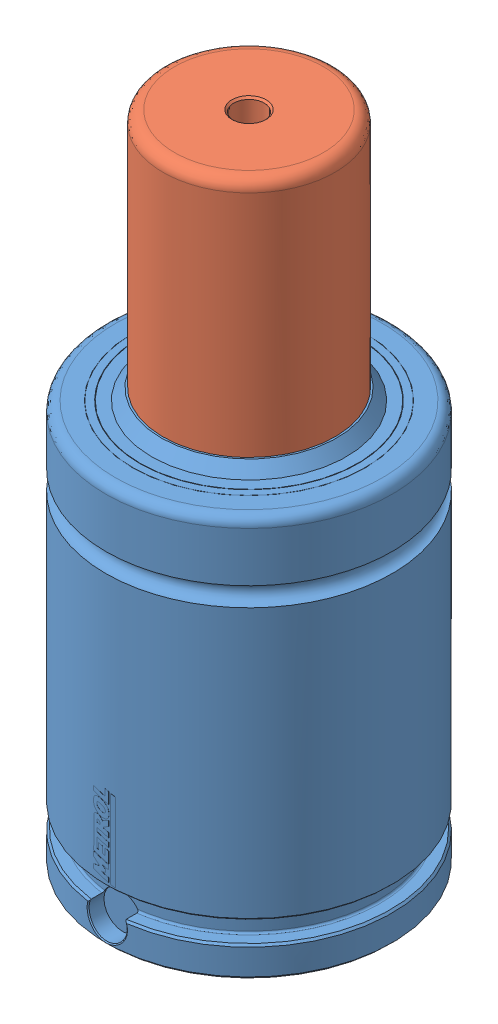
SolidWorks assembly EX2400-063.SLDASM, configuration Default (file format 7000). Lengths in mm.
Overall size (75 171 75.1).
2 component instances, 2 part files, 5 mates.
Components (placement in the parent):
- EX-2400 Body-1: EX-2400 Body.SLDPRT [EX-2500-063] x (0 0 1) z (0 -1 0) size (75.1 75 108)
- EX-2400 Piston-1: EX-2400 Piston.SLDPRT [EX-2500-063] at (0 90 0) x (0.984099 0 0.177618) z (0 -1 0) size (60 60 81)
Mates (geometry in assembly coordinates):
- Concentric1: concentric anti-aligned: cylinder of EX-2400 Body-1 through (0 0 0) axis (0 -1 0) radius 22.5; cylinder of EX-2400 Piston-1 through (0 159.6906 0) axis (0 1 0) radius 22.5
- LimitDistance1: limit distance anti-aligned: plane of EX-2400 Piston-1 through (-5.3285 95 29.523) normal (0 1 0); plane of EX-2400 Body-1 through (-22.5 95 0) normal (0 -1 0)
- Coincident1: coincident anti-aligned: plane of EX-2400 Body-1 through (0 0 0) normal (0 -1 0); plane of assembly through (0 0 0) normal (0 1 0)
- Coincident2: coincident aligned: plane of EX-2400 Body-1; plane of assembly through (0 0 0) normal (0 0 1)
- Coincident3: coincident anti-aligned: plane of EX-2400 Body-1; plane of assembly through (0 0 0) normal (1 0 0)
